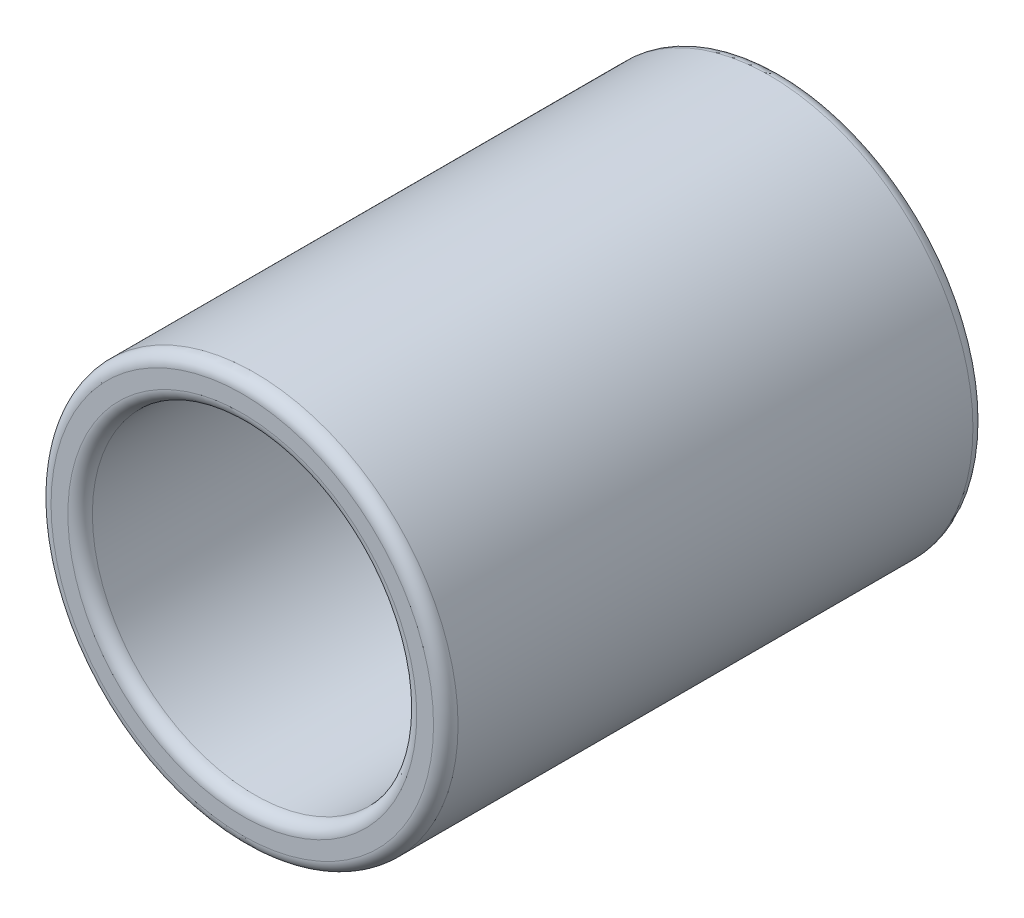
ISO-10303-21;
HEADER;
FILE_DESCRIPTION(('STEP AP214'),'2;1');
FILE_NAME('part.step','',(''),(''),'','','');
FILE_SCHEMA(('AUTOMOTIVE_DESIGN { 1 0 10303 214 1 1 1 1 }'));
ENDSEC;
DATA;
#1=APPLICATION_CONTEXT('core data for automotive mechanical design processes');
#2=APPLICATION_PROTOCOL_DEFINITION('international standard','automotive_design',2000,#1);
#3=PRODUCT_CONTEXT('',#1,'mechanical');
#4=PRODUCT('Part','Part','',(#3));
#5=PRODUCT_RELATED_PRODUCT_CATEGORY('part','',(#4));
#6=PRODUCT_DEFINITION_FORMATION('','',#4);
#7=PRODUCT_DEFINITION_CONTEXT('part definition',#1,'design');
#8=PRODUCT_DEFINITION('design','',#6,#7);
#9=PRODUCT_DEFINITION_SHAPE('','',#8);
#10=(LENGTH_UNIT() NAMED_UNIT(*) SI_UNIT(.MILLI.,.METRE.));
#11=(NAMED_UNIT(*) PLANE_ANGLE_UNIT() SI_UNIT($,.RADIAN.));
#12=(NAMED_UNIT(*) SI_UNIT($,.STERADIAN.) SOLID_ANGLE_UNIT());
#13=UNCERTAINTY_MEASURE_WITH_UNIT(LENGTH_MEASURE(1.E-05),#10,'distance_accuracy_value','');
#14=(GEOMETRIC_REPRESENTATION_CONTEXT(3) GLOBAL_UNCERTAINTY_ASSIGNED_CONTEXT((#13)) GLOBAL_UNIT_ASSIGNED_CONTEXT((#10,
#11,#12)) REPRESENTATION_CONTEXT('',''));
#15=CARTESIAN_POINT('',(0.,0.,0.));
#16=DIRECTION('',(0.,0.,1.));
#17=DIRECTION('',(1.,0.,0.));
#18=AXIS2_PLACEMENT_3D('',#15,#16,#17);
#19=CARTESIAN_POINT('',(0.,0.,27.94));
#20=DIRECTION('',(0.,0.,-1.));
#21=DIRECTION('',(-1.,0.,0.));
#22=AXIS2_PLACEMENT_3D('',#19,#20,#21);
#23=CYLINDRICAL_SURFACE('',#22,16.8021);
#24=CARTESIAN_POINT('',(0.,0.,-26.67));
#25=DIRECTION('',(0.,0.,1.));
#26=DIRECTION('',(1.,0.,0.));
#27=AXIS2_PLACEMENT_3D('',#24,#25,#26);
#28=CIRCLE('',#27,16.8021);
#29=CARTESIAN_POINT('',(16.8021,0.,-26.67));
#30=VERTEX_POINT('',#29);
#31=EDGE_CURVE('E55',#30,#30,#28,.F.);
#32=ORIENTED_EDGE('',*,*,#31,.T.);
#33=EDGE_LOOP('',(#32));
#34=FACE_BOUND('',#33,.T.);
#35=CARTESIAN_POINT('',(0.,0.,-1.27));
#36=DIRECTION('',(0.,0.,1.));
#37=DIRECTION('',(1.,0.,0.));
#38=AXIS2_PLACEMENT_3D('',#35,#36,#37);
#39=CIRCLE('',#38,16.8021);
#40=CARTESIAN_POINT('',(16.8021,0.,-1.27));
#41=VERTEX_POINT('',#40);
#42=EDGE_CURVE('E70',#41,#41,#39,.T.);
#43=ORIENTED_EDGE('',*,*,#42,.T.);
#44=EDGE_LOOP('',(#43));
#45=FACE_BOUND('',#44,.T.);
#46=ADVANCED_FACE('F32',(#34,#45),#23,.F.);
#47=CARTESIAN_POINT('',(0.,0.,27.94));
#48=DIRECTION('',(0.,0.,1.));
#49=DIRECTION('',(1.,0.,0.));
#50=AXIS2_PLACEMENT_3D('',#47,#48,#49);
#51=PLANE('',#50);
#52=CARTESIAN_POINT('',(0.,0.,27.94));
#53=DIRECTION('',(0.,0.,1.));
#54=DIRECTION('',(1.,0.,0.));
#55=AXIS2_PLACEMENT_3D('',#52,#53,#54);
#56=CIRCLE('',#55,19.812);
#57=CARTESIAN_POINT('',(19.812,0.,27.94));
#58=VERTEX_POINT('',#57);
#59=EDGE_CURVE('E39',#58,#58,#56,.T.);
#60=ORIENTED_EDGE('',*,*,#59,.T.);
#61=EDGE_LOOP('',(#60));
#62=FACE_BOUND('',#61,.T.);
#63=CARTESIAN_POINT('',(0.,0.,27.94));
#64=DIRECTION('',(0.,0.,1.));
#65=DIRECTION('',(1.,0.,0.));
#66=AXIS2_PLACEMENT_3D('',#63,#64,#65);
#67=CIRCLE('',#66,18.0721);
#68=CARTESIAN_POINT('',(18.0721,0.,27.94));
#69=VERTEX_POINT('',#68);
#70=EDGE_CURVE('E43',#69,#69,#67,.F.);
#71=ORIENTED_EDGE('',*,*,#70,.T.);
#72=EDGE_LOOP('',(#71));
#73=FACE_BOUND('',#72,.T.);
#74=ADVANCED_FACE('F95',(#62,#73),#51,.T.);
#75=CARTESIAN_POINT('',(0.,0.,27.94));
#76=DIRECTION('',(0.,0.,-1.));
#77=DIRECTION('',(-1.,0.,0.));
#78=AXIS2_PLACEMENT_3D('',#75,#76,#77);
#79=CYLINDRICAL_SURFACE('',#78,21.082);
#80=CARTESIAN_POINT('',(0.,0.,-26.67));
#81=DIRECTION('',(0.,0.,1.));
#82=DIRECTION('',(1.,0.,0.));
#83=AXIS2_PLACEMENT_3D('',#80,#81,#82);
#84=CIRCLE('',#83,21.082);
#85=CARTESIAN_POINT('',(21.082,0.,-26.67));
#86=VERTEX_POINT('',#85);
#87=EDGE_CURVE('E47',#86,#86,#84,.T.);
#88=ORIENTED_EDGE('',*,*,#87,.T.);
#89=EDGE_LOOP('',(#88));
#90=FACE_BOUND('',#89,.T.);
#91=CARTESIAN_POINT('',(0.,0.,26.67));
#92=DIRECTION('',(0.,0.,1.));
#93=DIRECTION('',(1.,0.,0.));
#94=AXIS2_PLACEMENT_3D('',#91,#92,#93);
#95=CIRCLE('',#94,21.082);
#96=CARTESIAN_POINT('',(21.082,0.,26.67));
#97=VERTEX_POINT('',#96);
#98=EDGE_CURVE('E52',#97,#97,#95,.F.);
#99=ORIENTED_EDGE('',*,*,#98,.T.);
#100=EDGE_LOOP('',(#99));
#101=FACE_BOUND('',#100,.T.);
#102=ADVANCED_FACE('F34',(#90,#101),#79,.T.);
#103=CARTESIAN_POINT('',(0.,0.,26.67));
#104=DIRECTION('',(0.,0.,1.));
#105=DIRECTION('',(1.,0.,0.));
#106=AXIS2_PLACEMENT_3D('',#103,#104,#105);
#107=CIRCLE('',#106,16.8021);
#108=CARTESIAN_POINT('',(16.8021,0.,26.67));
#109=VERTEX_POINT('',#108);
#110=EDGE_CURVE('E10',#109,#109,#107,.T.);
#111=ORIENTED_EDGE('',*,*,#110,.T.);
#112=EDGE_LOOP('',(#111));
#113=FACE_BOUND('',#112,.T.);
#114=CARTESIAN_POINT('',(0.,0.,1.27));
#115=DIRECTION('',(0.,0.,1.));
#116=DIRECTION('',(1.,0.,0.));
#117=AXIS2_PLACEMENT_3D('',#114,#115,#116);
#118=CIRCLE('',#117,16.8021);
#119=CARTESIAN_POINT('',(16.8021,0.,1.27));
#120=VERTEX_POINT('',#119);
#121=EDGE_CURVE('E64',#120,#120,#118,.T.);
#122=ORIENTED_EDGE('',*,*,#121,.F.);
#123=EDGE_LOOP('',(#122));
#124=FACE_BOUND('',#123,.T.);
#125=ADVANCED_FACE('F98',(#113,#124),#23,.F.);
#126=CARTESIAN_POINT('',(0.,0.,-27.94));
#127=DIRECTION('',(0.,0.,1.));
#128=DIRECTION('',(1.,0.,0.));
#129=AXIS2_PLACEMENT_3D('',#126,#127,#128);
#130=PLANE('',#129);
#131=CARTESIAN_POINT('',(0.,0.,-27.94));
#132=DIRECTION('',(0.,0.,1.));
#133=DIRECTION('',(1.,0.,0.));
#134=AXIS2_PLACEMENT_3D('',#131,#132,#133);
#135=CIRCLE('',#134,18.0721);
#136=CARTESIAN_POINT('',(18.0721,0.,-27.94));
#137=VERTEX_POINT('',#136);
#138=EDGE_CURVE('E58',#137,#137,#135,.T.);
#139=ORIENTED_EDGE('',*,*,#138,.T.);
#140=EDGE_LOOP('',(#139));
#141=FACE_BOUND('',#140,.T.);
#142=CARTESIAN_POINT('',(0.,0.,-27.94));
#143=DIRECTION('',(0.,0.,1.));
#144=DIRECTION('',(1.,0.,0.));
#145=AXIS2_PLACEMENT_3D('',#142,#143,#144);
#146=CIRCLE('',#145,19.812);
#147=CARTESIAN_POINT('',(19.812,0.,-27.94));
#148=VERTEX_POINT('',#147);
#149=EDGE_CURVE('E61',#148,#148,#146,.F.);
#150=ORIENTED_EDGE('',*,*,#149,.T.);
#151=EDGE_LOOP('',(#150));
#152=FACE_BOUND('',#151,.T.);
#153=ADVANCED_FACE('F91',(#141,#152),#130,.F.);
#154=CARTESIAN_POINT('',(0.,0.,1.27));
#155=DIRECTION('',(0.,0.,1.));
#156=DIRECTION('',(1.,0.,0.));
#157=AXIS2_PLACEMENT_3D('',#154,#155,#156);
#158=PLANE('',#157);
#159=ORIENTED_EDGE('',*,*,#121,.T.);
#160=EDGE_LOOP('',(#159));
#161=FACE_BOUND('',#160,.T.);
#162=CARTESIAN_POINT('',(0.,0.,1.27));
#163=DIRECTION('',(0.,0.,1.));
#164=DIRECTION('',(1.,0.,0.));
#165=AXIS2_PLACEMENT_3D('',#162,#163,#164);
#166=CIRCLE('',#165,13.0105409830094);
#167=CARTESIAN_POINT('',(13.0105409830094,0.,1.27));
#168=VERTEX_POINT('',#167);
#169=EDGE_CURVE('E67',#168,#168,#166,.T.);
#170=ORIENTED_EDGE('',*,*,#169,.F.);
#171=EDGE_LOOP('',(#170));
#172=FACE_BOUND('',#171,.T.);
#173=ADVANCED_FACE('F82',(#161,#172),#158,.T.);
#174=CARTESIAN_POINT('',(0.,0.,1.27));
#175=DIRECTION('',(0.,0.,-1.));
#176=DIRECTION('',(-1.,0.,0.));
#177=AXIS2_PLACEMENT_3D('',#174,#175,#176);
#178=CYLINDRICAL_SURFACE('',#177,13.0105409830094);
#179=ORIENTED_EDGE('',*,*,#169,.T.);
#180=EDGE_LOOP('',(#179));
#181=FACE_BOUND('',#180,.T.);
#182=CARTESIAN_POINT('',(0.,0.,-1.27));
#183=DIRECTION('',(0.,0.,1.));
#184=DIRECTION('',(1.,0.,0.));
#185=AXIS2_PLACEMENT_3D('',#182,#183,#184);
#186=CIRCLE('',#185,13.0105409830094);
#187=CARTESIAN_POINT('',(13.0105409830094,0.,-1.27));
#188=VERTEX_POINT('',#187);
#189=EDGE_CURVE('E73',#188,#188,#186,.T.);
#190=ORIENTED_EDGE('',*,*,#189,.F.);
#191=EDGE_LOOP('',(#190));
#192=FACE_BOUND('',#191,.T.);
#193=ADVANCED_FACE('F80',(#181,#192),#178,.F.);
#194=CARTESIAN_POINT('',(0.,0.,-1.27));
#195=DIRECTION('',(0.,0.,1.));
#196=DIRECTION('',(1.,0.,0.));
#197=AXIS2_PLACEMENT_3D('',#194,#195,#196);
#198=PLANE('',#197);
#199=ORIENTED_EDGE('',*,*,#189,.T.);
#200=EDGE_LOOP('',(#199));
#201=FACE_BOUND('',#200,.T.);
#202=ORIENTED_EDGE('',*,*,#42,.F.);
#203=EDGE_LOOP('',(#202));
#204=FACE_BOUND('',#203,.T.);
#205=ADVANCED_FACE('F77',(#201,#204),#198,.F.);
#206=CARTESIAN_POINT('',(0.,0.,-26.67));
#207=DIRECTION('',(0.,0.,1.));
#208=DIRECTION('',(1.,0.,0.));
#209=AXIS2_PLACEMENT_3D('',#206,#207,#208);
#210=TOROIDAL_SURFACE('',#209,18.0721,1.27);
#211=ORIENTED_EDGE('',*,*,#31,.F.);
#212=EDGE_LOOP('',(#211));
#213=FACE_BOUND('',#212,.T.);
#214=ORIENTED_EDGE('',*,*,#138,.F.);
#215=EDGE_LOOP('',(#214));
#216=FACE_BOUND('',#215,.T.);
#217=ADVANCED_FACE('F89',(#213,#216),#210,.T.);
#218=CARTESIAN_POINT('',(0.,0.,-26.67));
#219=DIRECTION('',(0.,0.,1.));
#220=DIRECTION('',(1.,0.,0.));
#221=AXIS2_PLACEMENT_3D('',#218,#219,#220);
#222=TOROIDAL_SURFACE('',#221,19.812,1.27);
#223=ORIENTED_EDGE('',*,*,#149,.F.);
#224=EDGE_LOOP('',(#223));
#225=FACE_BOUND('',#224,.T.);
#226=ORIENTED_EDGE('',*,*,#87,.F.);
#227=EDGE_LOOP('',(#226));
#228=FACE_BOUND('',#227,.T.);
#229=ADVANCED_FACE('F125',(#225,#228),#222,.T.);
#230=CARTESIAN_POINT('',(0.,0.,26.67));
#231=DIRECTION('',(0.,0.,1.));
#232=DIRECTION('',(1.,0.,0.));
#233=AXIS2_PLACEMENT_3D('',#230,#231,#232);
#234=TOROIDAL_SURFACE('',#233,19.812,1.27);
#235=ORIENTED_EDGE('',*,*,#98,.F.);
#236=EDGE_LOOP('',(#235));
#237=FACE_BOUND('',#236,.T.);
#238=ORIENTED_EDGE('',*,*,#59,.F.);
#239=EDGE_LOOP('',(#238));
#240=FACE_BOUND('',#239,.T.);
#241=ADVANCED_FACE('F121',(#237,#240),#234,.T.);
#242=CARTESIAN_POINT('',(0.,0.,26.67));
#243=DIRECTION('',(0.,0.,1.));
#244=DIRECTION('',(1.,0.,0.));
#245=AXIS2_PLACEMENT_3D('',#242,#243,#244);
#246=TOROIDAL_SURFACE('',#245,18.0721,1.27);
#247=ORIENTED_EDGE('',*,*,#70,.F.);
#248=EDGE_LOOP('',(#247));
#249=FACE_BOUND('',#248,.T.);
#250=ORIENTED_EDGE('',*,*,#110,.F.);
#251=EDGE_LOOP('',(#250));
#252=FACE_BOUND('',#251,.T.);
#253=ADVANCED_FACE('F124',(#249,#252),#246,.T.);
#254=CLOSED_SHELL('',(#46,#74,#102,#125,#153,#173,#193,#205,#217,#229,#241,#253));
#255=MANIFOLD_SOLID_BREP('B2',#254);
#256=ADVANCED_BREP_SHAPE_REPRESENTATION('',(#18,#255),#14);
#257=SHAPE_DEFINITION_REPRESENTATION(#9,#256);
ENDSEC;
END-ISO-10303-21;
